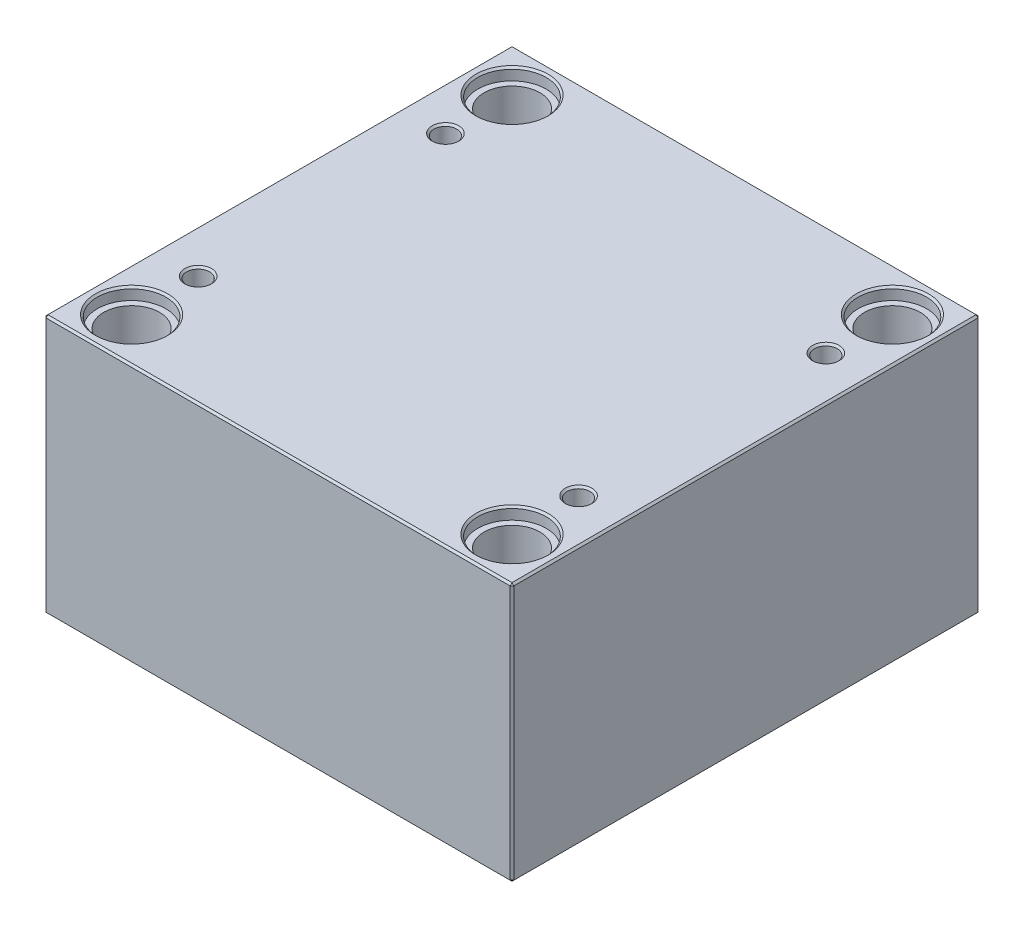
ISO-10303-21;
HEADER;
FILE_DESCRIPTION(('STEP AP214'),'2;1');
FILE_NAME('part.step','',(''),(''),'','','');
FILE_SCHEMA(('AUTOMOTIVE_DESIGN { 1 0 10303 214 1 1 1 1 }'));
ENDSEC;
DATA;
#1=APPLICATION_CONTEXT('core data for automotive mechanical design processes');
#2=APPLICATION_PROTOCOL_DEFINITION('international standard','automotive_design',2000,#1);
#3=PRODUCT_CONTEXT('',#1,'mechanical');
#4=PRODUCT('Part','Part','',(#3));
#5=PRODUCT_RELATED_PRODUCT_CATEGORY('part','',(#4));
#6=PRODUCT_DEFINITION_FORMATION('','',#4);
#7=PRODUCT_DEFINITION_CONTEXT('part definition',#1,'design');
#8=PRODUCT_DEFINITION('design','',#6,#7);
#9=PRODUCT_DEFINITION_SHAPE('','',#8);
#10=(LENGTH_UNIT() NAMED_UNIT(*) SI_UNIT(.MILLI.,.METRE.));
#11=(NAMED_UNIT(*) PLANE_ANGLE_UNIT() SI_UNIT($,.RADIAN.));
#12=(NAMED_UNIT(*) SI_UNIT($,.STERADIAN.) SOLID_ANGLE_UNIT());
#13=UNCERTAINTY_MEASURE_WITH_UNIT(LENGTH_MEASURE(1.E-05),#10,'distance_accuracy_value','');
#14=(GEOMETRIC_REPRESENTATION_CONTEXT(3) GLOBAL_UNCERTAINTY_ASSIGNED_CONTEXT((#13)) GLOBAL_UNIT_ASSIGNED_CONTEXT((#10,
#11,#12)) REPRESENTATION_CONTEXT('',''));
#15=CARTESIAN_POINT('',(0.,0.,0.));
#16=DIRECTION('',(0.,0.,1.));
#17=DIRECTION('',(1.,0.,0.));
#18=AXIS2_PLACEMENT_3D('',#15,#16,#17);
#19=CARTESIAN_POINT('',(-100.,0.,-100.));
#20=DIRECTION('',(0.,1.,0.));
#21=DIRECTION('',(0.,0.,1.));
#22=AXIS2_PLACEMENT_3D('',#19,#20,#21);
#23=CYLINDRICAL_SURFACE('',#22,14.7);
#24=CARTESIAN_POINT('',(-100.,0.999999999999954,-100.));
#25=DIRECTION('',(0.,1.,0.));
#26=DIRECTION('',(0.,0.,1.));
#27=AXIS2_PLACEMENT_3D('',#24,#25,#26);
#28=CIRCLE('',#27,14.7);
#29=CARTESIAN_POINT('',(-100.,0.999999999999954,-85.3));
#30=VERTEX_POINT('',#29);
#31=EDGE_CURVE('E472',#30,#30,#28,.F.);
#32=ORIENTED_EDGE('',*,*,#31,.T.);
#33=EDGE_LOOP('',(#32));
#34=FACE_BOUND('',#33,.T.);
#35=CARTESIAN_POINT('',(-100.,129.7,-100.));
#36=DIRECTION('',(0.,1.,0.));
#37=DIRECTION('',(0.,0.,1.));
#38=AXIS2_PLACEMENT_3D('',#35,#36,#37);
#39=CIRCLE('',#38,14.7);
#40=CARTESIAN_POINT('',(-100.,129.7,-85.3));
#41=VERTEX_POINT('',#40);
#42=EDGE_CURVE('E221',#41,#41,#39,.F.);
#43=ORIENTED_EDGE('',*,*,#42,.F.);
#44=EDGE_LOOP('',(#43));
#45=FACE_BOUND('',#44,.T.);
#46=ADVANCED_FACE('F16',(#34,#45),#23,.F.);
#47=CARTESIAN_POINT('',(100.,0.,-100.));
#48=DIRECTION('',(0.,1.,0.));
#49=DIRECTION('',(0.,0.,1.));
#50=AXIS2_PLACEMENT_3D('',#47,#48,#49);
#51=CYLINDRICAL_SURFACE('',#50,14.7);
#52=CARTESIAN_POINT('',(100.,0.999999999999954,-100.));
#53=DIRECTION('',(0.,1.,0.));
#54=DIRECTION('',(0.,0.,1.));
#55=AXIS2_PLACEMENT_3D('',#52,#53,#54);
#56=CIRCLE('',#55,14.7);
#57=CARTESIAN_POINT('',(100.,0.999999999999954,-85.3));
#58=VERTEX_POINT('',#57);
#59=EDGE_CURVE('E474',#58,#58,#56,.F.);
#60=ORIENTED_EDGE('',*,*,#59,.T.);
#61=EDGE_LOOP('',(#60));
#62=FACE_BOUND('',#61,.T.);
#63=CARTESIAN_POINT('',(100.,129.7,-100.));
#64=DIRECTION('',(0.,1.,0.));
#65=DIRECTION('',(0.,0.,1.));
#66=AXIS2_PLACEMENT_3D('',#63,#64,#65);
#67=CIRCLE('',#66,14.7);
#68=CARTESIAN_POINT('',(100.,129.7,-85.3));
#69=VERTEX_POINT('',#68);
#70=EDGE_CURVE('E218',#69,#69,#67,.F.);
#71=ORIENTED_EDGE('',*,*,#70,.F.);
#72=EDGE_LOOP('',(#71));
#73=FACE_BOUND('',#72,.T.);
#74=ADVANCED_FACE('F263',(#62,#73),#51,.F.);
#75=CARTESIAN_POINT('',(100.,0.,100.));
#76=DIRECTION('',(0.,1.,0.));
#77=DIRECTION('',(0.,0.,1.));
#78=AXIS2_PLACEMENT_3D('',#75,#76,#77);
#79=CYLINDRICAL_SURFACE('',#78,14.7);
#80=CARTESIAN_POINT('',(100.,1.00000000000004,100.));
#81=DIRECTION('',(0.,1.,0.));
#82=DIRECTION('',(0.,0.,1.));
#83=AXIS2_PLACEMENT_3D('',#80,#81,#82);
#84=CIRCLE('',#83,14.7);
#85=CARTESIAN_POINT('',(100.,1.00000000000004,114.7));
#86=VERTEX_POINT('',#85);
#87=EDGE_CURVE('E477',#86,#86,#84,.F.);
#88=ORIENTED_EDGE('',*,*,#87,.T.);
#89=EDGE_LOOP('',(#88));
#90=FACE_BOUND('',#89,.T.);
#91=CARTESIAN_POINT('',(100.,129.7,100.));
#92=DIRECTION('',(0.,1.,0.));
#93=DIRECTION('',(0.,0.,1.));
#94=AXIS2_PLACEMENT_3D('',#91,#92,#93);
#95=CIRCLE('',#94,14.7);
#96=CARTESIAN_POINT('',(100.,129.7,114.7));
#97=VERTEX_POINT('',#96);
#98=EDGE_CURVE('E214',#97,#97,#95,.F.);
#99=ORIENTED_EDGE('',*,*,#98,.F.);
#100=EDGE_LOOP('',(#99));
#101=FACE_BOUND('',#100,.T.);
#102=ADVANCED_FACE('F270',(#90,#101),#79,.F.);
#103=CARTESIAN_POINT('',(-100.,0.,100.));
#104=DIRECTION('',(0.,1.,0.));
#105=DIRECTION('',(0.,0.,1.));
#106=AXIS2_PLACEMENT_3D('',#103,#104,#105);
#107=CYLINDRICAL_SURFACE('',#106,14.7);
#108=CARTESIAN_POINT('',(-100.,0.999999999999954,100.));
#109=DIRECTION('',(0.,1.,0.));
#110=DIRECTION('',(0.,0.,1.));
#111=AXIS2_PLACEMENT_3D('',#108,#109,#110);
#112=CIRCLE('',#111,14.7);
#113=CARTESIAN_POINT('',(-100.,0.999999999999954,114.7));
#114=VERTEX_POINT('',#113);
#115=EDGE_CURVE('E480',#114,#114,#112,.F.);
#116=ORIENTED_EDGE('',*,*,#115,.T.);
#117=EDGE_LOOP('',(#116));
#118=FACE_BOUND('',#117,.T.);
#119=CARTESIAN_POINT('',(-100.,129.7,100.));
#120=DIRECTION('',(0.,1.,0.));
#121=DIRECTION('',(0.,0.,1.));
#122=AXIS2_PLACEMENT_3D('',#119,#120,#121);
#123=CIRCLE('',#122,14.7);
#124=CARTESIAN_POINT('',(-100.,129.7,114.7));
#125=VERTEX_POINT('',#124);
#126=EDGE_CURVE('E211',#125,#125,#123,.F.);
#127=ORIENTED_EDGE('',*,*,#126,.F.);
#128=EDGE_LOOP('',(#127));
#129=FACE_BOUND('',#128,.T.);
#130=ADVANCED_FACE('F277',(#118,#129),#107,.F.);
#131=CARTESIAN_POINT('',(-123.,136.,123.));
#132=DIRECTION('',(1.,0.,0.));
#133=DIRECTION('',(0.,0.,-1.));
#134=AXIS2_PLACEMENT_3D('',#131,#132,#133);
#135=PLANE('',#134);
#136=DIRECTION('',(0.,-1.,0.));
#137=VECTOR('',#136,1.);
#138=CARTESIAN_POINT('',(-123.,136.,-122.));
#139=LINE('',#138,#137);
#140=CARTESIAN_POINT('',(-123.,135.,-122.));
#141=VERTEX_POINT('',#140);
#142=CARTESIAN_POINT('',(-123.,0.999999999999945,-122.));
#143=VERTEX_POINT('',#142);
#144=EDGE_CURVE('E487',#141,#143,#139,.T.);
#145=ORIENTED_EDGE('',*,*,#144,.T.);
#146=DIRECTION('',(0.,0.,1.));
#147=VECTOR('',#146,1.);
#148=CARTESIAN_POINT('',(-123.,0.999999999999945,123.));
#149=LINE('',#148,#147);
#150=CARTESIAN_POINT('',(-123.,0.999999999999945,122.));
#151=VERTEX_POINT('',#150);
#152=EDGE_CURVE('E490',#143,#151,#149,.T.);
#153=ORIENTED_EDGE('',*,*,#152,.T.);
#154=DIRECTION('',(0.,1.,0.));
#155=VECTOR('',#154,1.);
#156=CARTESIAN_POINT('',(-123.,136.,122.));
#157=LINE('',#156,#155);
#158=CARTESIAN_POINT('',(-123.,135.,122.));
#159=VERTEX_POINT('',#158);
#160=EDGE_CURVE('E485',#151,#159,#157,.T.);
#161=ORIENTED_EDGE('',*,*,#160,.T.);
#162=DIRECTION('',(0.,0.,-1.));
#163=VECTOR('',#162,1.);
#164=CARTESIAN_POINT('',(-123.,135.,-123.));
#165=LINE('',#164,#163);
#166=EDGE_CURVE('E483',#159,#141,#165,.T.);
#167=ORIENTED_EDGE('',*,*,#166,.T.);
#168=EDGE_LOOP('',(#145,#153,#161,#167));
#169=FACE_BOUND('',#168,.T.);
#170=ADVANCED_FACE('F298',(#169),#135,.F.);
#171=CARTESIAN_POINT('',(123.,136.,123.));
#172=DIRECTION('',(0.,0.,-1.));
#173=DIRECTION('',(-1.,0.,0.));
#174=AXIS2_PLACEMENT_3D('',#171,#172,#173);
#175=PLANE('',#174);
#176=DIRECTION('',(-1.,0.,0.));
#177=VECTOR('',#176,1.);
#178=CARTESIAN_POINT('',(-123.,135.,123.));
#179=LINE('',#178,#177);
#180=CARTESIAN_POINT('',(122.,135.,123.));
#181=VERTEX_POINT('',#180);
#182=CARTESIAN_POINT('',(-122.,135.,123.));
#183=VERTEX_POINT('',#182);
#184=EDGE_CURVE('E509',#181,#183,#179,.T.);
#185=ORIENTED_EDGE('',*,*,#184,.T.);
#186=DIRECTION('',(0.,-1.,0.));
#187=VECTOR('',#186,1.);
#188=CARTESIAN_POINT('',(-122.,136.,123.));
#189=LINE('',#188,#187);
#190=CARTESIAN_POINT('',(-122.,0.999999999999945,123.));
#191=VERTEX_POINT('',#190);
#192=EDGE_CURVE('E515',#183,#191,#189,.T.);
#193=ORIENTED_EDGE('',*,*,#192,.T.);
#194=DIRECTION('',(1.,0.,0.));
#195=VECTOR('',#194,1.);
#196=CARTESIAN_POINT('',(123.,0.999999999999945,123.));
#197=LINE('',#196,#195);
#198=CARTESIAN_POINT('',(122.,0.999999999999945,123.));
#199=VERTEX_POINT('',#198);
#200=EDGE_CURVE('E513',#191,#199,#197,.T.);
#201=ORIENTED_EDGE('',*,*,#200,.T.);
#202=DIRECTION('',(0.,1.,0.));
#203=VECTOR('',#202,1.);
#204=CARTESIAN_POINT('',(122.,136.,123.));
#205=LINE('',#204,#203);
#206=EDGE_CURVE('E511',#199,#181,#205,.T.);
#207=ORIENTED_EDGE('',*,*,#206,.T.);
#208=EDGE_LOOP('',(#185,#193,#201,#207));
#209=FACE_BOUND('',#208,.T.);
#210=ADVANCED_FACE('F294',(#209),#175,.F.);
#211=CARTESIAN_POINT('',(123.,136.,123.));
#212=DIRECTION('',(-1.,0.,0.));
#213=DIRECTION('',(0.,0.,1.));
#214=AXIS2_PLACEMENT_3D('',#211,#212,#213);
#215=PLANE('',#214);
#216=DIRECTION('',(0.,0.,-1.));
#217=VECTOR('',#216,1.);
#218=CARTESIAN_POINT('',(123.,0.999999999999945,123.));
#219=LINE('',#218,#217);
#220=CARTESIAN_POINT('',(123.,0.999999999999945,122.));
#221=VERTEX_POINT('',#220);
#222=CARTESIAN_POINT('',(123.,0.999999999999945,-122.));
#223=VERTEX_POINT('',#222);
#224=EDGE_CURVE('E504',#221,#223,#219,.T.);
#225=ORIENTED_EDGE('',*,*,#224,.T.);
#226=DIRECTION('',(0.,1.,0.));
#227=VECTOR('',#226,1.);
#228=CARTESIAN_POINT('',(123.,136.,-122.));
#229=LINE('',#228,#227);
#230=CARTESIAN_POINT('',(123.,135.,-122.));
#231=VERTEX_POINT('',#230);
#232=EDGE_CURVE('E506',#223,#231,#229,.T.);
#233=ORIENTED_EDGE('',*,*,#232,.T.);
#234=DIRECTION('',(0.,0.,1.));
#235=VECTOR('',#234,1.);
#236=CARTESIAN_POINT('',(123.,135.,123.));
#237=LINE('',#236,#235);
#238=CARTESIAN_POINT('',(123.,135.,122.));
#239=VERTEX_POINT('',#238);
#240=EDGE_CURVE('E500',#231,#239,#237,.T.);
#241=ORIENTED_EDGE('',*,*,#240,.T.);
#242=DIRECTION('',(0.,-1.,0.));
#243=VECTOR('',#242,1.);
#244=CARTESIAN_POINT('',(123.,136.,122.));
#245=LINE('',#244,#243);
#246=EDGE_CURVE('E502',#239,#221,#245,.T.);
#247=ORIENTED_EDGE('',*,*,#246,.T.);
#248=EDGE_LOOP('',(#225,#233,#241,#247));
#249=FACE_BOUND('',#248,.T.);
#250=ADVANCED_FACE('F290',(#249),#215,.F.);
#251=CARTESIAN_POINT('',(123.,136.,-123.));
#252=DIRECTION('',(0.,0.,1.));
#253=DIRECTION('',(1.,0.,0.));
#254=AXIS2_PLACEMENT_3D('',#251,#252,#253);
#255=PLANE('',#254);
#256=DIRECTION('',(0.,-1.,0.));
#257=VECTOR('',#256,1.);
#258=CARTESIAN_POINT('',(122.,136.,-123.));
#259=LINE('',#258,#257);
#260=CARTESIAN_POINT('',(122.,135.,-123.));
#261=VERTEX_POINT('',#260);
#262=CARTESIAN_POINT('',(122.,0.999999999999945,-123.));
#263=VERTEX_POINT('',#262);
#264=EDGE_CURVE('E494',#261,#263,#259,.T.);
#265=ORIENTED_EDGE('',*,*,#264,.T.);
#266=DIRECTION('',(-1.,0.,0.));
#267=VECTOR('',#266,1.);
#268=CARTESIAN_POINT('',(123.,0.999999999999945,-123.));
#269=LINE('',#268,#267);
#270=CARTESIAN_POINT('',(-122.,0.999999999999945,-123.));
#271=VERTEX_POINT('',#270);
#272=EDGE_CURVE('E138',#263,#271,#269,.T.);
#273=ORIENTED_EDGE('',*,*,#272,.T.);
#274=DIRECTION('',(0.,1.,0.));
#275=VECTOR('',#274,1.);
#276=CARTESIAN_POINT('',(-122.,136.,-123.));
#277=LINE('',#276,#275);
#278=CARTESIAN_POINT('',(-122.,135.,-123.));
#279=VERTEX_POINT('',#278);
#280=EDGE_CURVE('E496',#271,#279,#277,.T.);
#281=ORIENTED_EDGE('',*,*,#280,.T.);
#282=DIRECTION('',(1.,0.,0.));
#283=VECTOR('',#282,1.);
#284=CARTESIAN_POINT('',(123.,135.,-123.));
#285=LINE('',#284,#283);
#286=EDGE_CURVE('E492',#279,#261,#285,.T.);
#287=ORIENTED_EDGE('',*,*,#286,.T.);
#288=EDGE_LOOP('',(#265,#273,#281,#287));
#289=FACE_BOUND('',#288,.T.);
#290=ADVANCED_FACE('F282',(#289),#255,.F.);
#291=CARTESIAN_POINT('',(0.,136.,0.));
#292=DIRECTION('',(0.,1.,0.));
#293=DIRECTION('',(0.,0.,1.));
#294=AXIS2_PLACEMENT_3D('',#291,#292,#293);
#295=PLANE('',#294);
#296=CARTESIAN_POINT('',(100.,136.,100.));
#297=DIRECTION('',(0.,1.,0.));
#298=DIRECTION('',(0.,0.,1.));
#299=AXIS2_PLACEMENT_3D('',#296,#297,#298);
#300=CIRCLE('',#299,19.);
#301=CARTESIAN_POINT('',(100.,136.,119.));
#302=VERTEX_POINT('',#301);
#303=EDGE_CURVE('E236',#302,#302,#300,.F.);
#304=ORIENTED_EDGE('',*,*,#303,.T.);
#305=EDGE_LOOP('',(#304));
#306=FACE_BOUND('',#305,.T.);
#307=CARTESIAN_POINT('',(-100.,136.,100.));
#308=DIRECTION('',(0.,1.,0.));
#309=DIRECTION('',(0.,0.,1.));
#310=AXIS2_PLACEMENT_3D('',#307,#308,#309);
#311=CIRCLE('',#310,19.);
#312=CARTESIAN_POINT('',(-100.,136.,119.));
#313=VERTEX_POINT('',#312);
#314=EDGE_CURVE('E233',#313,#313,#311,.F.);
#315=ORIENTED_EDGE('',*,*,#314,.T.);
#316=EDGE_LOOP('',(#315));
#317=FACE_BOUND('',#316,.T.);
#318=CARTESIAN_POINT('',(100.,136.,-100.));
#319=DIRECTION('',(0.,1.,0.));
#320=DIRECTION('',(0.,0.,1.));
#321=AXIS2_PLACEMENT_3D('',#318,#319,#320);
#322=CIRCLE('',#321,19.);
#323=CARTESIAN_POINT('',(100.,136.,-81.));
#324=VERTEX_POINT('',#323);
#325=EDGE_CURVE('E230',#324,#324,#322,.F.);
#326=ORIENTED_EDGE('',*,*,#325,.T.);
#327=EDGE_LOOP('',(#326));
#328=FACE_BOUND('',#327,.T.);
#329=CARTESIAN_POINT('',(-100.,136.,-100.));
#330=DIRECTION('',(0.,1.,0.));
#331=DIRECTION('',(0.,0.,1.));
#332=AXIS2_PLACEMENT_3D('',#329,#330,#331);
#333=CIRCLE('',#332,19.);
#334=CARTESIAN_POINT('',(-100.,136.,-81.));
#335=VERTEX_POINT('',#334);
#336=EDGE_CURVE('E227',#335,#335,#333,.F.);
#337=ORIENTED_EDGE('',*,*,#336,.T.);
#338=EDGE_LOOP('',(#337));
#339=FACE_BOUND('',#338,.T.);
#340=CARTESIAN_POINT('',(-100.,136.,65.));
#341=DIRECTION('',(0.,1.,0.));
#342=DIRECTION('',(0.,0.,1.));
#343=AXIS2_PLACEMENT_3D('',#340,#341,#342);
#344=CIRCLE('',#343,7.);
#345=CARTESIAN_POINT('',(-100.,136.,72.));
#346=VERTEX_POINT('',#345);
#347=EDGE_CURVE('E198',#346,#346,#344,.F.);
#348=ORIENTED_EDGE('',*,*,#347,.T.);
#349=EDGE_LOOP('',(#348));
#350=FACE_BOUND('',#349,.T.);
#351=CARTESIAN_POINT('',(100.,136.,65.));
#352=DIRECTION('',(0.,1.,0.));
#353=DIRECTION('',(0.,0.,1.));
#354=AXIS2_PLACEMENT_3D('',#351,#352,#353);
#355=CIRCLE('',#354,7.);
#356=CARTESIAN_POINT('',(100.,136.,72.));
#357=VERTEX_POINT('',#356);
#358=EDGE_CURVE('E195',#357,#357,#355,.F.);
#359=ORIENTED_EDGE('',*,*,#358,.T.);
#360=EDGE_LOOP('',(#359));
#361=FACE_BOUND('',#360,.T.);
#362=CARTESIAN_POINT('',(100.,136.,-65.));
#363=DIRECTION('',(0.,1.,0.));
#364=DIRECTION('',(0.,0.,1.));
#365=AXIS2_PLACEMENT_3D('',#362,#363,#364);
#366=CIRCLE('',#365,7.);
#367=CARTESIAN_POINT('',(100.,136.,-58.));
#368=VERTEX_POINT('',#367);
#369=EDGE_CURVE('E192',#368,#368,#366,.F.);
#370=ORIENTED_EDGE('',*,*,#369,.T.);
#371=EDGE_LOOP('',(#370));
#372=FACE_BOUND('',#371,.T.);
#373=CARTESIAN_POINT('',(-100.,136.,-65.));
#374=DIRECTION('',(0.,1.,0.));
#375=DIRECTION('',(0.,0.,1.));
#376=AXIS2_PLACEMENT_3D('',#373,#374,#375);
#377=CIRCLE('',#376,7.);
#378=CARTESIAN_POINT('',(-100.,136.,-58.));
#379=VERTEX_POINT('',#378);
#380=EDGE_CURVE('E188',#379,#379,#377,.F.);
#381=ORIENTED_EDGE('',*,*,#380,.T.);
#382=EDGE_LOOP('',(#381));
#383=FACE_BOUND('',#382,.T.);
#384=DIRECTION('',(0.,0.,-1.));
#385=VECTOR('',#384,1.);
#386=CARTESIAN_POINT('',(122.,136.,-123.));
#387=LINE('',#386,#385);
#388=CARTESIAN_POINT('',(122.,136.,122.));
#389=VERTEX_POINT('',#388);
#390=CARTESIAN_POINT('',(122.,136.,-122.));
#391=VERTEX_POINT('',#390);
#392=EDGE_CURVE('E31',#389,#391,#387,.T.);
#393=ORIENTED_EDGE('',*,*,#392,.T.);
#394=DIRECTION('',(-1.,0.,0.));
#395=VECTOR('',#394,1.);
#396=CARTESIAN_POINT('',(-123.,136.,-122.));
#397=LINE('',#396,#395);
#398=CARTESIAN_POINT('',(-122.,136.,-122.));
#399=VERTEX_POINT('',#398);
#400=EDGE_CURVE('E189',#391,#399,#397,.T.);
#401=ORIENTED_EDGE('',*,*,#400,.T.);
#402=DIRECTION('',(0.,0.,1.));
#403=VECTOR('',#402,1.);
#404=CARTESIAN_POINT('',(-122.,136.,123.));
#405=LINE('',#404,#403);
#406=CARTESIAN_POINT('',(-122.,136.,122.));
#407=VERTEX_POINT('',#406);
#408=EDGE_CURVE('E518',#399,#407,#405,.T.);
#409=ORIENTED_EDGE('',*,*,#408,.T.);
#410=DIRECTION('',(1.,0.,0.));
#411=VECTOR('',#410,1.);
#412=CARTESIAN_POINT('',(123.,136.,122.));
#413=LINE('',#412,#411);
#414=EDGE_CURVE('E36',#407,#389,#413,.T.);
#415=ORIENTED_EDGE('',*,*,#414,.T.);
#416=EDGE_LOOP('',(#393,#401,#409,#415));
#417=FACE_BOUND('',#416,.T.);
#418=ADVANCED_FACE('F279',(#306,#317,#328,#339,#350,#361,#372,#383,#417),#295,.T.);
#419=CARTESIAN_POINT('',(0.,0.,0.));
#420=DIRECTION('',(0.,1.,0.));
#421=DIRECTION('',(0.,0.,1.));
#422=AXIS2_PLACEMENT_3D('',#419,#420,#421);
#423=PLANE('',#422);
#424=CARTESIAN_POINT('',(-100.,0.,-100.));
#425=DIRECTION('',(0.,1.,0.));
#426=DIRECTION('',(0.,0.,1.));
#427=AXIS2_PLACEMENT_3D('',#424,#425,#426);
#428=CIRCLE('',#427,15.7);
#429=CARTESIAN_POINT('',(-100.,0.,-84.3));
#430=VERTEX_POINT('',#429);
#431=EDGE_CURVE('E469',#430,#430,#428,.T.);
#432=ORIENTED_EDGE('',*,*,#431,.T.);
#433=EDGE_LOOP('',(#432));
#434=FACE_BOUND('',#433,.T.);
#435=CARTESIAN_POINT('',(100.,0.,-100.));
#436=DIRECTION('',(0.,1.,0.));
#437=DIRECTION('',(0.,0.,1.));
#438=AXIS2_PLACEMENT_3D('',#435,#436,#437);
#439=CIRCLE('',#438,15.7);
#440=CARTESIAN_POINT('',(100.,0.,-84.3));
#441=VERTEX_POINT('',#440);
#442=EDGE_CURVE('E466',#441,#441,#439,.T.);
#443=ORIENTED_EDGE('',*,*,#442,.T.);
#444=EDGE_LOOP('',(#443));
#445=FACE_BOUND('',#444,.T.);
#446=CARTESIAN_POINT('',(100.,0.,100.));
#447=DIRECTION('',(0.,1.,0.));
#448=DIRECTION('',(0.,0.,1.));
#449=AXIS2_PLACEMENT_3D('',#446,#447,#448);
#450=CIRCLE('',#449,15.7);
#451=CARTESIAN_POINT('',(100.,0.,115.7));
#452=VERTEX_POINT('',#451);
#453=EDGE_CURVE('E463',#452,#452,#450,.T.);
#454=ORIENTED_EDGE('',*,*,#453,.T.);
#455=EDGE_LOOP('',(#454));
#456=FACE_BOUND('',#455,.T.);
#457=CARTESIAN_POINT('',(-100.,0.,100.));
#458=DIRECTION('',(0.,1.,0.));
#459=DIRECTION('',(0.,0.,1.));
#460=AXIS2_PLACEMENT_3D('',#457,#458,#459);
#461=CIRCLE('',#460,15.7);
#462=CARTESIAN_POINT('',(-100.,0.,115.7));
#463=VERTEX_POINT('',#462);
#464=EDGE_CURVE('E460',#463,#463,#461,.T.);
#465=ORIENTED_EDGE('',*,*,#464,.T.);
#466=EDGE_LOOP('',(#465));
#467=FACE_BOUND('',#466,.T.);
#468=DIRECTION('',(0.,0.,1.));
#469=VECTOR('',#468,1.);
#470=CARTESIAN_POINT('',(122.,0.,0.));
#471=LINE('',#470,#469);
#472=CARTESIAN_POINT('',(122.,0.,-122.));
#473=VERTEX_POINT('',#472);
#474=CARTESIAN_POINT('',(122.,0.,122.));
#475=VERTEX_POINT('',#474);
#476=EDGE_CURVE('E108',#473,#475,#471,.T.);
#477=ORIENTED_EDGE('',*,*,#476,.T.);
#478=DIRECTION('',(-1.,0.,0.));
#479=VECTOR('',#478,1.);
#480=CARTESIAN_POINT('',(0.,0.,122.));
#481=LINE('',#480,#479);
#482=CARTESIAN_POINT('',(-122.,0.,122.));
#483=VERTEX_POINT('',#482);
#484=EDGE_CURVE('E458',#475,#483,#481,.T.);
#485=ORIENTED_EDGE('',*,*,#484,.T.);
#486=DIRECTION('',(0.,0.,-1.));
#487=VECTOR('',#486,1.);
#488=CARTESIAN_POINT('',(-122.,0.,0.));
#489=LINE('',#488,#487);
#490=CARTESIAN_POINT('',(-122.,0.,-122.));
#491=VERTEX_POINT('',#490);
#492=EDGE_CURVE('E110',#483,#491,#489,.T.);
#493=ORIENTED_EDGE('',*,*,#492,.T.);
#494=DIRECTION('',(1.,0.,0.));
#495=VECTOR('',#494,1.);
#496=CARTESIAN_POINT('',(0.,0.,-122.));
#497=LINE('',#496,#495);
#498=EDGE_CURVE('E104',#491,#473,#497,.T.);
#499=ORIENTED_EDGE('',*,*,#498,.T.);
#500=EDGE_LOOP('',(#477,#485,#493,#499));
#501=FACE_BOUND('',#500,.T.);
#502=ADVANCED_FACE('F106',(#434,#445,#456,#467,#501),#423,.F.);
#503=CARTESIAN_POINT('',(-100.,0.,-100.));
#504=DIRECTION('',(0.,-1.,0.));
#505=DIRECTION('',(0.,0.,-1.));
#506=AXIS2_PLACEMENT_3D('',#503,#504,#505);
#507=CONICAL_SURFACE('',#506,15.7,0.785398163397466);
#508=ORIENTED_EDGE('',*,*,#31,.F.);
#509=EDGE_LOOP('',(#508));
#510=FACE_BOUND('',#509,.T.);
#511=ORIENTED_EDGE('',*,*,#431,.F.);
#512=EDGE_LOOP('',(#511));
#513=FACE_BOUND('',#512,.T.);
#514=ADVANCED_FACE('F286',(#510,#513),#507,.F.);
#515=CARTESIAN_POINT('',(100.,0.,-100.));
#516=DIRECTION('',(0.,-1.,0.));
#517=DIRECTION('',(0.,0.,-1.));
#518=AXIS2_PLACEMENT_3D('',#515,#516,#517);
#519=CONICAL_SURFACE('',#518,15.7,0.785398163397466);
#520=ORIENTED_EDGE('',*,*,#59,.F.);
#521=EDGE_LOOP('',(#520));
#522=FACE_BOUND('',#521,.T.);
#523=ORIENTED_EDGE('',*,*,#442,.F.);
#524=EDGE_LOOP('',(#523));
#525=FACE_BOUND('',#524,.T.);
#526=ADVANCED_FACE('F305',(#522,#525),#519,.F.);
#527=CARTESIAN_POINT('',(100.,0.,100.));
#528=DIRECTION('',(0.,-1.,0.));
#529=DIRECTION('',(0.,0.,-1.));
#530=AXIS2_PLACEMENT_3D('',#527,#528,#529);
#531=CONICAL_SURFACE('',#530,15.7,0.785398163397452);
#532=ORIENTED_EDGE('',*,*,#87,.F.);
#533=EDGE_LOOP('',(#532));
#534=FACE_BOUND('',#533,.T.);
#535=ORIENTED_EDGE('',*,*,#453,.F.);
#536=EDGE_LOOP('',(#535));
#537=FACE_BOUND('',#536,.T.);
#538=ADVANCED_FACE('F309',(#534,#537),#531,.F.);
#539=CARTESIAN_POINT('',(-100.,0.,100.));
#540=DIRECTION('',(0.,-1.,0.));
#541=DIRECTION('',(0.,0.,-1.));
#542=AXIS2_PLACEMENT_3D('',#539,#540,#541);
#543=CONICAL_SURFACE('',#542,15.7,0.785398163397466);
#544=ORIENTED_EDGE('',*,*,#115,.F.);
#545=EDGE_LOOP('',(#544));
#546=FACE_BOUND('',#545,.T.);
#547=ORIENTED_EDGE('',*,*,#464,.F.);
#548=EDGE_LOOP('',(#547));
#549=FACE_BOUND('',#548,.T.);
#550=ADVANCED_FACE('F313',(#546,#549),#543,.F.);
#551=CARTESIAN_POINT('',(123.,136.,122.));
#552=DIRECTION('',(-0.707106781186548,0.,-0.707106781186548));
#553=DIRECTION('',(0.,-1.,0.));
#554=AXIS2_PLACEMENT_3D('',#551,#552,#553);
#555=PLANE('',#554);
#556=DIRECTION('',(-0.707106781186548,0.,0.707106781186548));
#557=VECTOR('',#556,1.);
#558=CARTESIAN_POINT('',(122.,135.,123.));
#559=LINE('',#558,#557);
#560=EDGE_CURVE('E126',#181,#239,#559,.F.);
#561=ORIENTED_EDGE('',*,*,#560,.F.);
#562=ORIENTED_EDGE('',*,*,#206,.F.);
#563=DIRECTION('',(0.707106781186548,0.,-0.707106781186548));
#564=VECTOR('',#563,1.);
#565=CARTESIAN_POINT('',(122.,0.999999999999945,123.));
#566=LINE('',#565,#564);
#567=EDGE_CURVE('E180',#221,#199,#566,.F.);
#568=ORIENTED_EDGE('',*,*,#567,.F.);
#569=ORIENTED_EDGE('',*,*,#246,.F.);
#570=EDGE_LOOP('',(#561,#562,#568,#569));
#571=FACE_BOUND('',#570,.T.);
#572=ADVANCED_FACE('F317',(#571),#555,.F.);
#573=CARTESIAN_POINT('',(122.,135.,123.));
#574=DIRECTION('',(0.577350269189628,0.577350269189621,0.577350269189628));
#575=DIRECTION('',(0.707106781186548,0.,-0.707106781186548));
#576=AXIS2_PLACEMENT_3D('',#573,#574,#575);
#577=PLANE('',#576);
#578=DIRECTION('',(0.,-0.70710678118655,0.707106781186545));
#579=VECTOR('',#578,1.);
#580=CARTESIAN_POINT('',(122.,135.,123.));
#581=LINE('',#580,#579);
#582=EDGE_CURVE('E175',#181,#389,#581,.F.);
#583=ORIENTED_EDGE('',*,*,#582,.F.);
#584=ORIENTED_EDGE('',*,*,#560,.T.);
#585=DIRECTION('',(-0.707106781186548,0.707106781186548,0.));
#586=VECTOR('',#585,1.);
#587=CARTESIAN_POINT('',(122.5,135.5,122.));
#588=LINE('',#587,#586);
#589=EDGE_CURVE('E177',#389,#239,#588,.F.);
#590=ORIENTED_EDGE('',*,*,#589,.F.);
#591=EDGE_LOOP('',(#583,#584,#590));
#592=FACE_BOUND('',#591,.T.);
#593=ADVANCED_FACE('F385',(#592),#577,.T.);
#594=CARTESIAN_POINT('',(122.,0.999999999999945,123.));
#595=DIRECTION('',(0.577350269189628,-0.577350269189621,0.577350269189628));
#596=DIRECTION('',(0.707106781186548,0.,-0.707106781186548));
#597=AXIS2_PLACEMENT_3D('',#594,#595,#596);
#598=PLANE('',#597);
#599=DIRECTION('',(-0.707106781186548,-0.707106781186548,0.));
#600=VECTOR('',#599,1.);
#601=CARTESIAN_POINT('',(122.5,0.499999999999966,122.));
#602=LINE('',#601,#600);
#603=EDGE_CURVE('E124',#221,#475,#602,.T.);
#604=ORIENTED_EDGE('',*,*,#603,.F.);
#605=ORIENTED_EDGE('',*,*,#567,.T.);
#606=DIRECTION('',(0.,0.70710678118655,0.707106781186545));
#607=VECTOR('',#606,1.);
#608=CARTESIAN_POINT('',(122.,0.999999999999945,123.));
#609=LINE('',#608,#607);
#610=EDGE_CURVE('E172',#475,#199,#609,.T.);
#611=ORIENTED_EDGE('',*,*,#610,.F.);
#612=EDGE_LOOP('',(#604,#605,#611));
#613=FACE_BOUND('',#612,.T.);
#614=ADVANCED_FACE('F381',(#613),#598,.T.);
#615=CARTESIAN_POINT('',(122.,136.,0.));
#616=DIRECTION('',(0.707106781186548,0.707106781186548,0.));
#617=DIRECTION('',(0.,0.,1.));
#618=AXIS2_PLACEMENT_3D('',#615,#616,#617);
#619=PLANE('',#618);
#620=ORIENTED_EDGE('',*,*,#589,.T.);
#621=ORIENTED_EDGE('',*,*,#240,.F.);
#622=DIRECTION('',(0.707106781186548,-0.707106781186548,0.));
#623=VECTOR('',#622,1.);
#624=CARTESIAN_POINT('',(123.,135.,-122.));
#625=LINE('',#624,#623);
#626=EDGE_CURVE('E166',#391,#231,#625,.T.);
#627=ORIENTED_EDGE('',*,*,#626,.F.);
#628=ORIENTED_EDGE('',*,*,#392,.F.);
#629=EDGE_LOOP('',(#620,#621,#627,#628));
#630=FACE_BOUND('',#629,.T.);
#631=ADVANCED_FACE('F377',(#630),#619,.T.);
#632=CARTESIAN_POINT('',(0.,136.,122.));
#633=DIRECTION('',(0.,0.707106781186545,0.70710678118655));
#634=DIRECTION('',(-1.,0.,0.));
#635=AXIS2_PLACEMENT_3D('',#632,#633,#634);
#636=PLANE('',#635);
#637=ORIENTED_EDGE('',*,*,#582,.T.);
#638=ORIENTED_EDGE('',*,*,#414,.F.);
#639=DIRECTION('',(0.,0.70710678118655,-0.707106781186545));
#640=VECTOR('',#639,1.);
#641=CARTESIAN_POINT('',(-122.,135.5,122.5));
#642=LINE('',#641,#640);
#643=EDGE_CURVE('E163',#183,#407,#642,.T.);
#644=ORIENTED_EDGE('',*,*,#643,.F.);
#645=ORIENTED_EDGE('',*,*,#184,.F.);
#646=EDGE_LOOP('',(#637,#638,#644,#645));
#647=FACE_BOUND('',#646,.T.);
#648=ADVANCED_FACE('F373',(#647),#636,.T.);
#649=CARTESIAN_POINT('',(-122.,136.,123.));
#650=DIRECTION('',(0.707106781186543,0.,-0.707106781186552));
#651=DIRECTION('',(0.,-1.,0.));
#652=AXIS2_PLACEMENT_3D('',#649,#650,#651);
#653=PLANE('',#652);
#654=DIRECTION('',(0.707106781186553,0.,0.707106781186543));
#655=VECTOR('',#654,1.);
#656=CARTESIAN_POINT('',(-122.,0.999999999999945,123.));
#657=LINE('',#656,#655);
#658=EDGE_CURVE('E157',#191,#151,#657,.F.);
#659=ORIENTED_EDGE('',*,*,#658,.F.);
#660=ORIENTED_EDGE('',*,*,#192,.F.);
#661=DIRECTION('',(-0.707106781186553,0.,-0.707106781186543));
#662=VECTOR('',#661,1.);
#663=CARTESIAN_POINT('',(-123.,135.,122.));
#664=LINE('',#663,#662);
#665=EDGE_CURVE('E160',#159,#183,#664,.F.);
#666=ORIENTED_EDGE('',*,*,#665,.F.);
#667=ORIENTED_EDGE('',*,*,#160,.F.);
#668=EDGE_LOOP('',(#659,#660,#666,#667));
#669=FACE_BOUND('',#668,.T.);
#670=ADVANCED_FACE('F369',(#669),#653,.F.);
#671=CARTESIAN_POINT('',(123.,0.999999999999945,123.));
#672=DIRECTION('',(0.,0.707106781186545,-0.70710678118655));
#673=DIRECTION('',(1.,0.,0.));
#674=AXIS2_PLACEMENT_3D('',#671,#672,#673);
#675=PLANE('',#674);
#676=ORIENTED_EDGE('',*,*,#610,.T.);
#677=ORIENTED_EDGE('',*,*,#200,.F.);
#678=DIRECTION('',(0.,-0.70710678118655,-0.707106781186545));
#679=VECTOR('',#678,1.);
#680=CARTESIAN_POINT('',(-122.,0.999999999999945,123.));
#681=LINE('',#680,#679);
#682=EDGE_CURVE('E135',#483,#191,#681,.F.);
#683=ORIENTED_EDGE('',*,*,#682,.F.);
#684=ORIENTED_EDGE('',*,*,#484,.F.);
#685=EDGE_LOOP('',(#676,#677,#683,#684));
#686=FACE_BOUND('',#685,.T.);
#687=ADVANCED_FACE('F366',(#686),#675,.F.);
#688=CARTESIAN_POINT('',(123.,0.999999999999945,123.));
#689=DIRECTION('',(-0.707106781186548,0.707106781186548,0.));
#690=DIRECTION('',(0.,0.,-1.));
#691=AXIS2_PLACEMENT_3D('',#688,#689,#690);
#692=PLANE('',#691);
#693=ORIENTED_EDGE('',*,*,#603,.T.);
#694=ORIENTED_EDGE('',*,*,#476,.F.);
#695=DIRECTION('',(0.707106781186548,0.707106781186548,0.));
#696=VECTOR('',#695,1.);
#697=CARTESIAN_POINT('',(122.5,0.49999999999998,-122.));
#698=LINE('',#697,#696);
#699=EDGE_CURVE('E121',#223,#473,#698,.F.);
#700=ORIENTED_EDGE('',*,*,#699,.F.);
#701=ORIENTED_EDGE('',*,*,#224,.F.);
#702=EDGE_LOOP('',(#693,#694,#700,#701));
#703=FACE_BOUND('',#702,.T.);
#704=ADVANCED_FACE('F119',(#703),#692,.F.);
#705=CARTESIAN_POINT('',(122.,136.,-123.));
#706=DIRECTION('',(-0.707106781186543,0.,0.707106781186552));
#707=DIRECTION('',(0.,-1.,0.));
#708=AXIS2_PLACEMENT_3D('',#705,#706,#707);
#709=PLANE('',#708);
#710=DIRECTION('',(0.707106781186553,0.,0.707106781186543));
#711=VECTOR('',#710,1.);
#712=CARTESIAN_POINT('',(123.,135.,-122.));
#713=LINE('',#712,#711);
#714=EDGE_CURVE('E168',#231,#261,#713,.F.);
#715=ORIENTED_EDGE('',*,*,#714,.F.);
#716=ORIENTED_EDGE('',*,*,#232,.F.);
#717=DIRECTION('',(-0.707106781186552,0.,-0.707106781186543));
#718=VECTOR('',#717,1.);
#719=CARTESIAN_POINT('',(122.,0.999999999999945,-123.));
#720=LINE('',#719,#718);
#721=EDGE_CURVE('E134',#263,#223,#720,.F.);
#722=ORIENTED_EDGE('',*,*,#721,.F.);
#723=ORIENTED_EDGE('',*,*,#264,.F.);
#724=EDGE_LOOP('',(#715,#716,#722,#723));
#725=FACE_BOUND('',#724,.T.);
#726=ADVANCED_FACE('F359',(#725),#709,.F.);
#727=CARTESIAN_POINT('',(123.,135.,-122.));
#728=DIRECTION('',(0.57735026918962,0.577350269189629,-0.577350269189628));
#729=DIRECTION('',(0.,0.707106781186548,0.707106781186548));
#730=AXIS2_PLACEMENT_3D('',#727,#728,#729);
#731=PLANE('',#730);
#732=ORIENTED_EDGE('',*,*,#626,.T.);
#733=ORIENTED_EDGE('',*,*,#714,.T.);
#734=DIRECTION('',(0.,0.707106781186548,0.707106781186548));
#735=VECTOR('',#734,1.);
#736=CARTESIAN_POINT('',(122.,135.5,-122.5));
#737=LINE('',#736,#735);
#738=EDGE_CURVE('E152',#391,#261,#737,.F.);
#739=ORIENTED_EDGE('',*,*,#738,.F.);
#740=EDGE_LOOP('',(#732,#733,#739));
#741=FACE_BOUND('',#740,.T.);
#742=ADVANCED_FACE('F355',(#741),#731,.T.);
#743=CARTESIAN_POINT('',(-123.,135.,122.));
#744=DIRECTION('',(-0.577350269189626,0.577350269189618,0.577350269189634));
#745=DIRECTION('',(0.707106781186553,0.,0.707106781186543));
#746=AXIS2_PLACEMENT_3D('',#743,#744,#745);
#747=PLANE('',#746);
#748=ORIENTED_EDGE('',*,*,#665,.T.);
#749=ORIENTED_EDGE('',*,*,#643,.T.);
#750=DIRECTION('',(-0.707106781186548,-0.707106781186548,0.));
#751=VECTOR('',#750,1.);
#752=CARTESIAN_POINT('',(-123.,135.,122.));
#753=LINE('',#752,#751);
#754=EDGE_CURVE('E143',#159,#407,#753,.F.);
#755=ORIENTED_EDGE('',*,*,#754,.F.);
#756=EDGE_LOOP('',(#748,#749,#755));
#757=FACE_BOUND('',#756,.T.);
#758=ADVANCED_FACE('F351',(#757),#747,.T.);
#759=CARTESIAN_POINT('',(-122.,0.999999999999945,123.));
#760=DIRECTION('',(-0.577350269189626,-0.577350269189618,0.577350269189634));
#761=DIRECTION('',(0.707106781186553,0.,0.707106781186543));
#762=AXIS2_PLACEMENT_3D('',#759,#760,#761);
#763=PLANE('',#762);
#764=ORIENTED_EDGE('',*,*,#682,.T.);
#765=ORIENTED_EDGE('',*,*,#658,.T.);
#766=DIRECTION('',(-0.707106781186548,0.707106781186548,0.));
#767=VECTOR('',#766,1.);
#768=CARTESIAN_POINT('',(-122.5,0.499999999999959,122.));
#769=LINE('',#768,#767);
#770=EDGE_CURVE('E139',#483,#151,#769,.T.);
#771=ORIENTED_EDGE('',*,*,#770,.F.);
#772=EDGE_LOOP('',(#764,#765,#771));
#773=FACE_BOUND('',#772,.T.);
#774=ADVANCED_FACE('F348',(#773),#763,.T.);
#775=CARTESIAN_POINT('',(122.,0.999999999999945,-123.));
#776=DIRECTION('',(0.577350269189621,-0.577350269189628,-0.577350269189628));
#777=DIRECTION('',(0.,0.707106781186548,-0.707106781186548));
#778=AXIS2_PLACEMENT_3D('',#775,#776,#777);
#779=PLANE('',#778);
#780=ORIENTED_EDGE('',*,*,#721,.T.);
#781=ORIENTED_EDGE('',*,*,#699,.T.);
#782=DIRECTION('',(0.,-0.707106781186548,0.707106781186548));
#783=VECTOR('',#782,1.);
#784=CARTESIAN_POINT('',(122.,0.999999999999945,-123.));
#785=LINE('',#784,#783);
#786=EDGE_CURVE('E131',#263,#473,#785,.T.);
#787=ORIENTED_EDGE('',*,*,#786,.F.);
#788=EDGE_LOOP('',(#780,#781,#787));
#789=FACE_BOUND('',#788,.T.);
#790=ADVANCED_FACE('F130',(#789),#779,.T.);
#791=CARTESIAN_POINT('',(0.,136.,-122.));
#792=DIRECTION('',(0.,0.707106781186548,-0.707106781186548));
#793=DIRECTION('',(1.,0.,0.));
#794=AXIS2_PLACEMENT_3D('',#791,#792,#793);
#795=PLANE('',#794);
#796=ORIENTED_EDGE('',*,*,#738,.T.);
#797=ORIENTED_EDGE('',*,*,#286,.F.);
#798=DIRECTION('',(0.,-0.707106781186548,-0.707106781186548));
#799=VECTOR('',#798,1.);
#800=CARTESIAN_POINT('',(-122.,135.,-123.));
#801=LINE('',#800,#799);
#802=EDGE_CURVE('E140',#399,#279,#801,.T.);
#803=ORIENTED_EDGE('',*,*,#802,.F.);
#804=ORIENTED_EDGE('',*,*,#400,.F.);
#805=EDGE_LOOP('',(#796,#797,#803,#804));
#806=FACE_BOUND('',#805,.T.);
#807=ADVANCED_FACE('F341',(#806),#795,.T.);
#808=CARTESIAN_POINT('',(-122.,136.,0.));
#809=DIRECTION('',(-0.707106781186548,0.707106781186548,0.));
#810=DIRECTION('',(0.,0.,-1.));
#811=AXIS2_PLACEMENT_3D('',#808,#809,#810);
#812=PLANE('',#811);
#813=ORIENTED_EDGE('',*,*,#754,.T.);
#814=ORIENTED_EDGE('',*,*,#408,.F.);
#815=DIRECTION('',(0.707106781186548,0.707106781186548,0.));
#816=VECTOR('',#815,1.);
#817=CARTESIAN_POINT('',(-122.5,135.5,-122.));
#818=LINE('',#817,#816);
#819=EDGE_CURVE('E146',#141,#399,#818,.T.);
#820=ORIENTED_EDGE('',*,*,#819,.F.);
#821=ORIENTED_EDGE('',*,*,#166,.F.);
#822=EDGE_LOOP('',(#813,#814,#820,#821));
#823=FACE_BOUND('',#822,.T.);
#824=ADVANCED_FACE('F337',(#823),#812,.T.);
#825=CARTESIAN_POINT('',(-123.,0.999999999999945,123.));
#826=DIRECTION('',(0.707106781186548,0.707106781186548,0.));
#827=DIRECTION('',(0.,0.,1.));
#828=AXIS2_PLACEMENT_3D('',#825,#826,#827);
#829=PLANE('',#828);
#830=ORIENTED_EDGE('',*,*,#770,.T.);
#831=ORIENTED_EDGE('',*,*,#152,.F.);
#832=DIRECTION('',(0.707106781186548,-0.707106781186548,0.));
#833=VECTOR('',#832,1.);
#834=CARTESIAN_POINT('',(-123.,0.999999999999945,-122.));
#835=LINE('',#834,#833);
#836=EDGE_CURVE('E529',#491,#143,#835,.F.);
#837=ORIENTED_EDGE('',*,*,#836,.F.);
#838=ORIENTED_EDGE('',*,*,#492,.F.);
#839=EDGE_LOOP('',(#830,#831,#837,#838));
#840=FACE_BOUND('',#839,.T.);
#841=ADVANCED_FACE('F334',(#840),#829,.F.);
#842=CARTESIAN_POINT('',(123.,0.999999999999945,-123.));
#843=DIRECTION('',(0.,0.707106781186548,0.707106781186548));
#844=DIRECTION('',(-1.,0.,0.));
#845=AXIS2_PLACEMENT_3D('',#842,#843,#844);
#846=PLANE('',#845);
#847=ORIENTED_EDGE('',*,*,#786,.T.);
#848=ORIENTED_EDGE('',*,*,#498,.F.);
#849=DIRECTION('',(0.,0.707106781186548,-0.707106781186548));
#850=VECTOR('',#849,1.);
#851=CARTESIAN_POINT('',(-122.,0.499999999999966,-122.5));
#852=LINE('',#851,#850);
#853=EDGE_CURVE('E526',#271,#491,#852,.F.);
#854=ORIENTED_EDGE('',*,*,#853,.F.);
#855=ORIENTED_EDGE('',*,*,#272,.F.);
#856=EDGE_LOOP('',(#847,#848,#854,#855));
#857=FACE_BOUND('',#856,.T.);
#858=ADVANCED_FACE('F137',(#857),#846,.F.);
#859=CARTESIAN_POINT('',(-122.,135.,-123.));
#860=DIRECTION('',(-0.577350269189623,0.577350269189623,-0.577350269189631));
#861=DIRECTION('',(-0.707106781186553,0.,0.707106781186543));
#862=AXIS2_PLACEMENT_3D('',#859,#860,#861);
#863=PLANE('',#862);
#864=ORIENTED_EDGE('',*,*,#819,.T.);
#865=ORIENTED_EDGE('',*,*,#802,.T.);
#866=DIRECTION('',(0.707106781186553,0.,-0.707106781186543));
#867=VECTOR('',#866,1.);
#868=CARTESIAN_POINT('',(-122.,135.,-123.));
#869=LINE('',#868,#867);
#870=EDGE_CURVE('E524',#141,#279,#869,.T.);
#871=ORIENTED_EDGE('',*,*,#870,.F.);
#872=EDGE_LOOP('',(#864,#865,#871));
#873=FACE_BOUND('',#872,.T.);
#874=ADVANCED_FACE('F327',(#873),#863,.T.);
#875=CARTESIAN_POINT('',(-123.,0.999999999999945,-122.));
#876=DIRECTION('',(-0.577350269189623,-0.577350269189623,-0.577350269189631));
#877=DIRECTION('',(-0.707106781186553,0.,0.707106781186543));
#878=AXIS2_PLACEMENT_3D('',#875,#876,#877);
#879=PLANE('',#878);
#880=ORIENTED_EDGE('',*,*,#853,.T.);
#881=ORIENTED_EDGE('',*,*,#836,.T.);
#882=DIRECTION('',(-0.707106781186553,0.,0.707106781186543));
#883=VECTOR('',#882,1.);
#884=CARTESIAN_POINT('',(-123.,0.999999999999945,-122.));
#885=LINE('',#884,#883);
#886=EDGE_CURVE('E455',#271,#143,#885,.T.);
#887=ORIENTED_EDGE('',*,*,#886,.F.);
#888=EDGE_LOOP('',(#880,#881,#887));
#889=FACE_BOUND('',#888,.T.);
#890=ADVANCED_FACE('F323',(#889),#879,.T.);
#891=CARTESIAN_POINT('',(-123.,136.,-122.));
#892=DIRECTION('',(0.707106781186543,0.,0.707106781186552));
#893=DIRECTION('',(0.,-1.,0.));
#894=AXIS2_PLACEMENT_3D('',#891,#892,#893);
#895=PLANE('',#894);
#896=ORIENTED_EDGE('',*,*,#870,.T.);
#897=ORIENTED_EDGE('',*,*,#280,.F.);
#898=ORIENTED_EDGE('',*,*,#886,.T.);
#899=ORIENTED_EDGE('',*,*,#144,.F.);
#900=EDGE_LOOP('',(#896,#897,#898,#899));
#901=FACE_BOUND('',#900,.T.);
#902=ADVANCED_FACE('F319',(#901),#895,.F.);
#903=CARTESIAN_POINT('',(-100.,112.,-65.));
#904=DIRECTION('',(0.,1.,0.));
#905=DIRECTION('',(0.,0.,1.));
#906=AXIS2_PLACEMENT_3D('',#903,#904,#905);
#907=CYLINDRICAL_SURFACE('',#906,6.);
#908=CARTESIAN_POINT('',(-100.,135.,-65.));
#909=DIRECTION('',(0.,1.,0.));
#910=DIRECTION('',(0.,0.,1.));
#911=AXIS2_PLACEMENT_3D('',#908,#909,#910);
#912=CIRCLE('',#911,6.);
#913=CARTESIAN_POINT('',(-100.,135.,-59.));
#914=VERTEX_POINT('',#913);
#915=EDGE_CURVE('E207',#914,#914,#912,.T.);
#916=ORIENTED_EDGE('',*,*,#915,.T.);
#917=EDGE_LOOP('',(#916));
#918=FACE_BOUND('',#917,.T.);
#919=CARTESIAN_POINT('',(-100.,112.,-65.));
#920=DIRECTION('',(0.,1.,0.));
#921=DIRECTION('',(0.,0.,1.));
#922=AXIS2_PLACEMENT_3D('',#919,#920,#921);
#923=CIRCLE('',#922,6.);
#924=CARTESIAN_POINT('',(-100.,112.,-59.));
#925=VERTEX_POINT('',#924);
#926=EDGE_CURVE('E448',#925,#925,#923,.T.);
#927=ORIENTED_EDGE('',*,*,#926,.F.);
#928=EDGE_LOOP('',(#927));
#929=FACE_BOUND('',#928,.T.);
#930=ADVANCED_FACE('F322',(#918,#929),#907,.F.);
#931=CARTESIAN_POINT('',(-100.,112.,-65.));
#932=DIRECTION('',(0.,1.,0.));
#933=DIRECTION('',(0.,0.,1.));
#934=AXIS2_PLACEMENT_3D('',#931,#932,#933);
#935=PLANE('',#934);
#936=ORIENTED_EDGE('',*,*,#926,.T.);
#937=EDGE_LOOP('',(#936));
#938=FACE_BOUND('',#937,.T.);
#939=ADVANCED_FACE('F596',(#938),#935,.T.);
#940=CARTESIAN_POINT('',(100.,112.,-65.));
#941=DIRECTION('',(0.,1.,0.));
#942=DIRECTION('',(0.,0.,1.));
#943=AXIS2_PLACEMENT_3D('',#940,#941,#942);
#944=CYLINDRICAL_SURFACE('',#943,6.);
#945=CARTESIAN_POINT('',(100.,135.,-65.));
#946=DIRECTION('',(0.,1.,0.));
#947=DIRECTION('',(0.,0.,1.));
#948=AXIS2_PLACEMENT_3D('',#945,#946,#947);
#949=CIRCLE('',#948,6.);
#950=CARTESIAN_POINT('',(100.,135.,-59.));
#951=VERTEX_POINT('',#950);
#952=EDGE_CURVE('E204',#951,#951,#949,.T.);
#953=ORIENTED_EDGE('',*,*,#952,.T.);
#954=EDGE_LOOP('',(#953));
#955=FACE_BOUND('',#954,.T.);
#956=CARTESIAN_POINT('',(100.,112.,-65.));
#957=DIRECTION('',(0.,1.,0.));
#958=DIRECTION('',(0.,0.,1.));
#959=AXIS2_PLACEMENT_3D('',#956,#957,#958);
#960=CIRCLE('',#959,6.);
#961=CARTESIAN_POINT('',(100.,112.,-59.));
#962=VERTEX_POINT('',#961);
#963=EDGE_CURVE('E445',#962,#962,#960,.T.);
#964=ORIENTED_EDGE('',*,*,#963,.F.);
#965=EDGE_LOOP('',(#964));
#966=FACE_BOUND('',#965,.T.);
#967=ADVANCED_FACE('F592',(#955,#966),#944,.F.);
#968=CARTESIAN_POINT('',(100.,112.,-65.));
#969=DIRECTION('',(0.,1.,0.));
#970=DIRECTION('',(0.,0.,1.));
#971=AXIS2_PLACEMENT_3D('',#968,#969,#970);
#972=PLANE('',#971);
#973=ORIENTED_EDGE('',*,*,#963,.T.);
#974=EDGE_LOOP('',(#973));
#975=FACE_BOUND('',#974,.T.);
#976=ADVANCED_FACE('F588',(#975),#972,.T.);
#977=CARTESIAN_POINT('',(100.,112.,65.));
#978=DIRECTION('',(0.,1.,0.));
#979=DIRECTION('',(0.,0.,1.));
#980=AXIS2_PLACEMENT_3D('',#977,#978,#979);
#981=CYLINDRICAL_SURFACE('',#980,6.);
#982=CARTESIAN_POINT('',(100.,135.,65.));
#983=DIRECTION('',(0.,1.,0.));
#984=DIRECTION('',(0.,0.,1.));
#985=AXIS2_PLACEMENT_3D('',#982,#983,#984);
#986=CIRCLE('',#985,6.);
#987=CARTESIAN_POINT('',(100.,135.,71.));
#988=VERTEX_POINT('',#987);
#989=EDGE_CURVE('E201',#988,#988,#986,.T.);
#990=ORIENTED_EDGE('',*,*,#989,.T.);
#991=EDGE_LOOP('',(#990));
#992=FACE_BOUND('',#991,.T.);
#993=CARTESIAN_POINT('',(100.,112.,65.));
#994=DIRECTION('',(0.,1.,0.));
#995=DIRECTION('',(0.,0.,1.));
#996=AXIS2_PLACEMENT_3D('',#993,#994,#995);
#997=CIRCLE('',#996,6.);
#998=CARTESIAN_POINT('',(100.,112.,71.));
#999=VERTEX_POINT('',#998);
#1000=EDGE_CURVE('E449',#999,#999,#997,.T.);
#1001=ORIENTED_EDGE('',*,*,#1000,.F.);
#1002=EDGE_LOOP('',(#1001));
#1003=FACE_BOUND('',#1002,.T.);
#1004=ADVANCED_FACE('F591',(#992,#1003),#981,.F.);
#1005=CARTESIAN_POINT('',(100.,112.,65.));
#1006=DIRECTION('',(0.,1.,0.));
#1007=DIRECTION('',(0.,0.,1.));
#1008=AXIS2_PLACEMENT_3D('',#1005,#1006,#1007);
#1009=PLANE('',#1008);
#1010=ORIENTED_EDGE('',*,*,#1000,.T.);
#1011=EDGE_LOOP('',(#1010));
#1012=FACE_BOUND('',#1011,.T.);
#1013=ADVANCED_FACE('F598',(#1012),#1009,.T.);
#1014=CARTESIAN_POINT('',(-100.,112.,65.));
#1015=DIRECTION('',(0.,1.,0.));
#1016=DIRECTION('',(0.,0.,1.));
#1017=AXIS2_PLACEMENT_3D('',#1014,#1015,#1016);
#1018=CYLINDRICAL_SURFACE('',#1017,6.);
#1019=CARTESIAN_POINT('',(-100.,135.,65.));
#1020=DIRECTION('',(0.,1.,0.));
#1021=DIRECTION('',(0.,0.,1.));
#1022=AXIS2_PLACEMENT_3D('',#1019,#1020,#1021);
#1023=CIRCLE('',#1022,6.);
#1024=CARTESIAN_POINT('',(-100.,135.,71.));
#1025=VERTEX_POINT('',#1024);
#1026=EDGE_CURVE('E185',#1025,#1025,#1023,.T.);
#1027=ORIENTED_EDGE('',*,*,#1026,.T.);
#1028=EDGE_LOOP('',(#1027));
#1029=FACE_BOUND('',#1028,.T.);
#1030=CARTESIAN_POINT('',(-100.,112.,65.));
#1031=DIRECTION('',(0.,1.,0.));
#1032=DIRECTION('',(0.,0.,1.));
#1033=AXIS2_PLACEMENT_3D('',#1030,#1031,#1032);
#1034=CIRCLE('',#1033,6.);
#1035=CARTESIAN_POINT('',(-100.,112.,71.));
#1036=VERTEX_POINT('',#1035);
#1037=EDGE_CURVE('E224',#1036,#1036,#1034,.T.);
#1038=ORIENTED_EDGE('',*,*,#1037,.F.);
#1039=EDGE_LOOP('',(#1038));
#1040=FACE_BOUND('',#1039,.T.);
#1041=ADVANCED_FACE('F601',(#1029,#1040),#1018,.F.);
#1042=CARTESIAN_POINT('',(-100.,112.,65.));
#1043=DIRECTION('',(0.,1.,0.));
#1044=DIRECTION('',(0.,0.,1.));
#1045=AXIS2_PLACEMENT_3D('',#1042,#1043,#1044);
#1046=PLANE('',#1045);
#1047=ORIENTED_EDGE('',*,*,#1037,.T.);
#1048=EDGE_LOOP('',(#1047));
#1049=FACE_BOUND('',#1048,.T.);
#1050=ADVANCED_FACE('F397',(#1049),#1046,.T.);
#1051=CARTESIAN_POINT('',(-100.,135.,65.));
#1052=DIRECTION('',(0.,1.,0.));
#1053=DIRECTION('',(0.,0.,1.));
#1054=AXIS2_PLACEMENT_3D('',#1051,#1052,#1053);
#1055=CONICAL_SURFACE('',#1054,6.,0.785398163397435);
#1056=ORIENTED_EDGE('',*,*,#347,.F.);
#1057=EDGE_LOOP('',(#1056));
#1058=FACE_BOUND('',#1057,.T.);
#1059=ORIENTED_EDGE('',*,*,#1026,.F.);
#1060=EDGE_LOOP('',(#1059));
#1061=FACE_BOUND('',#1060,.T.);
#1062=ADVANCED_FACE('F393',(#1058,#1061),#1055,.F.);
#1063=CARTESIAN_POINT('',(100.,135.,65.));
#1064=DIRECTION('',(0.,1.,0.));
#1065=DIRECTION('',(0.,0.,1.));
#1066=AXIS2_PLACEMENT_3D('',#1063,#1064,#1065);
#1067=CONICAL_SURFACE('',#1066,6.,0.785398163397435);
#1068=ORIENTED_EDGE('',*,*,#358,.F.);
#1069=EDGE_LOOP('',(#1068));
#1070=FACE_BOUND('',#1069,.T.);
#1071=ORIENTED_EDGE('',*,*,#989,.F.);
#1072=EDGE_LOOP('',(#1071));
#1073=FACE_BOUND('',#1072,.T.);
#1074=ADVANCED_FACE('F396',(#1070,#1073),#1067,.F.);
#1075=CARTESIAN_POINT('',(100.,135.,-65.));
#1076=DIRECTION('',(0.,1.,0.));
#1077=DIRECTION('',(0.,0.,1.));
#1078=AXIS2_PLACEMENT_3D('',#1075,#1076,#1077);
#1079=CONICAL_SURFACE('',#1078,6.,0.785398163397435);
#1080=ORIENTED_EDGE('',*,*,#369,.F.);
#1081=EDGE_LOOP('',(#1080));
#1082=FACE_BOUND('',#1081,.T.);
#1083=ORIENTED_EDGE('',*,*,#952,.F.);
#1084=EDGE_LOOP('',(#1083));
#1085=FACE_BOUND('',#1084,.T.);
#1086=ADVANCED_FACE('F401',(#1082,#1085),#1079,.F.);
#1087=CARTESIAN_POINT('',(-100.,135.,-65.));
#1088=DIRECTION('',(0.,1.,0.));
#1089=DIRECTION('',(0.,0.,1.));
#1090=AXIS2_PLACEMENT_3D('',#1087,#1088,#1089);
#1091=CONICAL_SURFACE('',#1090,6.,0.785398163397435);
#1092=ORIENTED_EDGE('',*,*,#380,.F.);
#1093=EDGE_LOOP('',(#1092));
#1094=FACE_BOUND('',#1093,.T.);
#1095=ORIENTED_EDGE('',*,*,#915,.F.);
#1096=EDGE_LOOP('',(#1095));
#1097=FACE_BOUND('',#1096,.T.);
#1098=ADVANCED_FACE('F405',(#1094,#1097),#1091,.F.);
#1099=CARTESIAN_POINT('',(-100.,129.7,100.));
#1100=DIRECTION('',(0.,1.,0.));
#1101=DIRECTION('',(0.,0.,1.));
#1102=AXIS2_PLACEMENT_3D('',#1099,#1100,#1101);
#1103=PLANE('',#1102);
#1104=CARTESIAN_POINT('',(-100.,129.7,100.));
#1105=DIRECTION('',(0.,1.,0.));
#1106=DIRECTION('',(0.,0.,1.));
#1107=AXIS2_PLACEMENT_3D('',#1104,#1105,#1106);
#1108=CIRCLE('',#1107,18.);
#1109=CARTESIAN_POINT('',(-100.,129.7,118.));
#1110=VERTEX_POINT('',#1109);
#1111=EDGE_CURVE('E436',#1110,#1110,#1108,.T.);
#1112=ORIENTED_EDGE('',*,*,#1111,.T.);
#1113=EDGE_LOOP('',(#1112));
#1114=FACE_BOUND('',#1113,.T.);
#1115=ORIENTED_EDGE('',*,*,#126,.T.);
#1116=EDGE_LOOP('',(#1115));
#1117=FACE_BOUND('',#1116,.T.);
#1118=ADVANCED_FACE('F409',(#1114,#1117),#1103,.T.);
#1119=CARTESIAN_POINT('',(-100.,129.7,100.));
#1120=DIRECTION('',(0.,1.,0.));
#1121=DIRECTION('',(0.,0.,1.));
#1122=AXIS2_PLACEMENT_3D('',#1119,#1120,#1121);
#1123=CYLINDRICAL_SURFACE('',#1122,18.);
#1124=CARTESIAN_POINT('',(-100.,135.,100.));
#1125=DIRECTION('',(0.,1.,0.));
#1126=DIRECTION('',(0.,0.,1.));
#1127=AXIS2_PLACEMENT_3D('',#1124,#1125,#1126);
#1128=CIRCLE('',#1127,18.);
#1129=CARTESIAN_POINT('',(-100.,135.,118.));
#1130=VERTEX_POINT('',#1129);
#1131=EDGE_CURVE('E239',#1130,#1130,#1128,.T.);
#1132=ORIENTED_EDGE('',*,*,#1131,.T.);
#1133=EDGE_LOOP('',(#1132));
#1134=FACE_BOUND('',#1133,.T.);
#1135=ORIENTED_EDGE('',*,*,#1111,.F.);
#1136=EDGE_LOOP('',(#1135));
#1137=FACE_BOUND('',#1136,.T.);
#1138=ADVANCED_FACE('F574',(#1134,#1137),#1123,.F.);
#1139=CARTESIAN_POINT('',(100.,129.7,100.));
#1140=DIRECTION('',(0.,1.,0.));
#1141=DIRECTION('',(0.,0.,1.));
#1142=AXIS2_PLACEMENT_3D('',#1139,#1140,#1141);
#1143=PLANE('',#1142);
#1144=CARTESIAN_POINT('',(100.,129.7,100.));
#1145=DIRECTION('',(0.,1.,0.));
#1146=DIRECTION('',(0.,0.,1.));
#1147=AXIS2_PLACEMENT_3D('',#1144,#1145,#1146);
#1148=CIRCLE('',#1147,18.);
#1149=CARTESIAN_POINT('',(100.,129.7,118.));
#1150=VERTEX_POINT('',#1149);
#1151=EDGE_CURVE('E433',#1150,#1150,#1148,.T.);
#1152=ORIENTED_EDGE('',*,*,#1151,.T.);
#1153=EDGE_LOOP('',(#1152));
#1154=FACE_BOUND('',#1153,.T.);
#1155=ORIENTED_EDGE('',*,*,#98,.T.);
#1156=EDGE_LOOP('',(#1155));
#1157=FACE_BOUND('',#1156,.T.);
#1158=ADVANCED_FACE('F429',(#1154,#1157),#1143,.T.);
#1159=CARTESIAN_POINT('',(100.,129.7,100.));
#1160=DIRECTION('',(0.,1.,0.));
#1161=DIRECTION('',(0.,0.,1.));
#1162=AXIS2_PLACEMENT_3D('',#1159,#1160,#1161);
#1163=CYLINDRICAL_SURFACE('',#1162,18.);
#1164=CARTESIAN_POINT('',(100.,135.,100.));
#1165=DIRECTION('',(0.,1.,0.));
#1166=DIRECTION('',(0.,0.,1.));
#1167=AXIS2_PLACEMENT_3D('',#1164,#1165,#1166);
#1168=CIRCLE('',#1167,18.);
#1169=CARTESIAN_POINT('',(100.,135.,118.));
#1170=VERTEX_POINT('',#1169);
#1171=EDGE_CURVE('E210',#1170,#1170,#1168,.T.);
#1172=ORIENTED_EDGE('',*,*,#1171,.T.);
#1173=EDGE_LOOP('',(#1172));
#1174=FACE_BOUND('',#1173,.T.);
#1175=ORIENTED_EDGE('',*,*,#1151,.F.);
#1176=EDGE_LOOP('',(#1175));
#1177=FACE_BOUND('',#1176,.T.);
#1178=ADVANCED_FACE('F425',(#1174,#1177),#1163,.F.);
#1179=CARTESIAN_POINT('',(100.,129.7,-100.));
#1180=DIRECTION('',(0.,1.,0.));
#1181=DIRECTION('',(0.,0.,1.));
#1182=AXIS2_PLACEMENT_3D('',#1179,#1180,#1181);
#1183=PLANE('',#1182);
#1184=CARTESIAN_POINT('',(100.,129.7,-100.));
#1185=DIRECTION('',(0.,1.,0.));
#1186=DIRECTION('',(0.,0.,1.));
#1187=AXIS2_PLACEMENT_3D('',#1184,#1185,#1186);
#1188=CIRCLE('',#1187,18.);
#1189=CARTESIAN_POINT('',(100.,129.7,-82.));
#1190=VERTEX_POINT('',#1189);
#1191=EDGE_CURVE('E435',#1190,#1190,#1188,.T.);
#1192=ORIENTED_EDGE('',*,*,#1191,.T.);
#1193=EDGE_LOOP('',(#1192));
#1194=FACE_BOUND('',#1193,.T.);
#1195=ORIENTED_EDGE('',*,*,#70,.T.);
#1196=EDGE_LOOP('',(#1195));
#1197=FACE_BOUND('',#1196,.T.);
#1198=ADVANCED_FACE('F428',(#1194,#1197),#1183,.T.);
#1199=CARTESIAN_POINT('',(100.,129.7,-100.));
#1200=DIRECTION('',(0.,1.,0.));
#1201=DIRECTION('',(0.,0.,1.));
#1202=AXIS2_PLACEMENT_3D('',#1199,#1200,#1201);
#1203=CYLINDRICAL_SURFACE('',#1202,18.);
#1204=CARTESIAN_POINT('',(100.,135.,-100.));
#1205=DIRECTION('',(0.,1.,0.));
#1206=DIRECTION('',(0.,0.,1.));
#1207=AXIS2_PLACEMENT_3D('',#1204,#1205,#1206);
#1208=CIRCLE('',#1207,18.);
#1209=CARTESIAN_POINT('',(100.,135.,-82.));
#1210=VERTEX_POINT('',#1209);
#1211=EDGE_CURVE('E24',#1210,#1210,#1208,.T.);
#1212=ORIENTED_EDGE('',*,*,#1211,.T.);
#1213=EDGE_LOOP('',(#1212));
#1214=FACE_BOUND('',#1213,.T.);
#1215=ORIENTED_EDGE('',*,*,#1191,.F.);
#1216=EDGE_LOOP('',(#1215));
#1217=FACE_BOUND('',#1216,.T.);
#1218=ADVANCED_FACE('F244',(#1214,#1217),#1203,.F.);
#1219=CARTESIAN_POINT('',(-100.,129.7,-100.));
#1220=DIRECTION('',(0.,1.,0.));
#1221=DIRECTION('',(0.,0.,1.));
#1222=AXIS2_PLACEMENT_3D('',#1219,#1220,#1221);
#1223=PLANE('',#1222);
#1224=CARTESIAN_POINT('',(-100.,129.7,-100.));
#1225=DIRECTION('',(0.,1.,0.));
#1226=DIRECTION('',(0.,0.,1.));
#1227=AXIS2_PLACEMENT_3D('',#1224,#1225,#1226);
#1228=CIRCLE('',#1227,18.);
#1229=CARTESIAN_POINT('',(-100.,129.7,-82.));
#1230=VERTEX_POINT('',#1229);
#1231=EDGE_CURVE('E215',#1230,#1230,#1228,.T.);
#1232=ORIENTED_EDGE('',*,*,#1231,.T.);
#1233=EDGE_LOOP('',(#1232));
#1234=FACE_BOUND('',#1233,.T.);
#1235=ORIENTED_EDGE('',*,*,#42,.T.);
#1236=EDGE_LOOP('',(#1235));
#1237=FACE_BOUND('',#1236,.T.);
#1238=ADVANCED_FACE('F418',(#1234,#1237),#1223,.T.);
#1239=CARTESIAN_POINT('',(-100.,129.7,-100.));
#1240=DIRECTION('',(0.,1.,0.));
#1241=DIRECTION('',(0.,0.,1.));
#1242=AXIS2_PLACEMENT_3D('',#1239,#1240,#1241);
#1243=CYLINDRICAL_SURFACE('',#1242,18.);
#1244=CARTESIAN_POINT('',(-100.,135.,-100.));
#1245=DIRECTION('',(0.,1.,0.));
#1246=DIRECTION('',(0.,0.,1.));
#1247=AXIS2_PLACEMENT_3D('',#1244,#1245,#1246);
#1248=CIRCLE('',#1247,18.);
#1249=CARTESIAN_POINT('',(-100.,135.,-82.));
#1250=VERTEX_POINT('',#1249);
#1251=EDGE_CURVE('E10',#1250,#1250,#1248,.T.);
#1252=ORIENTED_EDGE('',*,*,#1251,.T.);
#1253=EDGE_LOOP('',(#1252));
#1254=FACE_BOUND('',#1253,.T.);
#1255=ORIENTED_EDGE('',*,*,#1231,.F.);
#1256=EDGE_LOOP('',(#1255));
#1257=FACE_BOUND('',#1256,.T.);
#1258=ADVANCED_FACE('F412',(#1254,#1257),#1243,.F.);
#1259=CARTESIAN_POINT('',(100.,135.,100.));
#1260=DIRECTION('',(0.,1.,0.));
#1261=DIRECTION('',(0.,0.,1.));
#1262=AXIS2_PLACEMENT_3D('',#1259,#1260,#1261);
#1263=CONICAL_SURFACE('',#1262,18.,0.785398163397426);
#1264=ORIENTED_EDGE('',*,*,#303,.F.);
#1265=EDGE_LOOP('',(#1264));
#1266=FACE_BOUND('',#1265,.T.);
#1267=ORIENTED_EDGE('',*,*,#1171,.F.);
#1268=EDGE_LOOP('',(#1267));
#1269=FACE_BOUND('',#1268,.T.);
#1270=ADVANCED_FACE('F258',(#1266,#1269),#1263,.F.);
#1271=CARTESIAN_POINT('',(-100.,135.,100.));
#1272=DIRECTION('',(0.,1.,0.));
#1273=DIRECTION('',(0.,0.,1.));
#1274=AXIS2_PLACEMENT_3D('',#1271,#1272,#1273);
#1275=CONICAL_SURFACE('',#1274,18.,0.785398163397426);
#1276=ORIENTED_EDGE('',*,*,#314,.F.);
#1277=EDGE_LOOP('',(#1276));
#1278=FACE_BOUND('',#1277,.T.);
#1279=ORIENTED_EDGE('',*,*,#1131,.F.);
#1280=EDGE_LOOP('',(#1279));
#1281=FACE_BOUND('',#1280,.T.);
#1282=ADVANCED_FACE('F249',(#1278,#1281),#1275,.F.);
#1283=CARTESIAN_POINT('',(100.,135.,-100.));
#1284=DIRECTION('',(0.,1.,0.));
#1285=DIRECTION('',(0.,0.,1.));
#1286=AXIS2_PLACEMENT_3D('',#1283,#1284,#1285);
#1287=CONICAL_SURFACE('',#1286,18.,0.785398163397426);
#1288=ORIENTED_EDGE('',*,*,#325,.F.);
#1289=EDGE_LOOP('',(#1288));
#1290=FACE_BOUND('',#1289,.T.);
#1291=ORIENTED_EDGE('',*,*,#1211,.F.);
#1292=EDGE_LOOP('',(#1291));
#1293=FACE_BOUND('',#1292,.T.);
#1294=ADVANCED_FACE('F247',(#1290,#1293),#1287,.F.);
#1295=CARTESIAN_POINT('',(-100.,135.,-100.));
#1296=DIRECTION('',(0.,1.,0.));
#1297=DIRECTION('',(0.,0.,1.));
#1298=AXIS2_PLACEMENT_3D('',#1295,#1296,#1297);
#1299=CONICAL_SURFACE('',#1298,18.,0.785398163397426);
#1300=ORIENTED_EDGE('',*,*,#336,.F.);
#1301=EDGE_LOOP('',(#1300));
#1302=FACE_BOUND('',#1301,.T.);
#1303=ORIENTED_EDGE('',*,*,#1251,.F.);
#1304=EDGE_LOOP('',(#1303));
#1305=FACE_BOUND('',#1304,.T.);
#1306=ADVANCED_FACE('F18',(#1302,#1305),#1299,.F.);
#1307=CLOSED_SHELL('',(#46,#74,#102,#130,#170,#210,#250,#290,#418,#502,#514,#526,#538,#550,#572,
#593,#614,#631,#648,#670,#687,#704,#726,#742,#758,#774,#790,#807,#824,#841,#858,#874,#890,#902,
#930,#939,#967,#976,#1004,#1013,#1041,#1050,#1062,#1074,#1086,#1098,#1118,#1138,#1158,#1178,
#1198,#1218,#1238,#1258,#1270,#1282,#1294,#1306));
#1308=MANIFOLD_SOLID_BREP('B1',#1307);
#1309=ADVANCED_BREP_SHAPE_REPRESENTATION('',(#18,#1308),#14);
#1310=SHAPE_DEFINITION_REPRESENTATION(#9,#1309);
ENDSEC;
END-ISO-10303-21;
